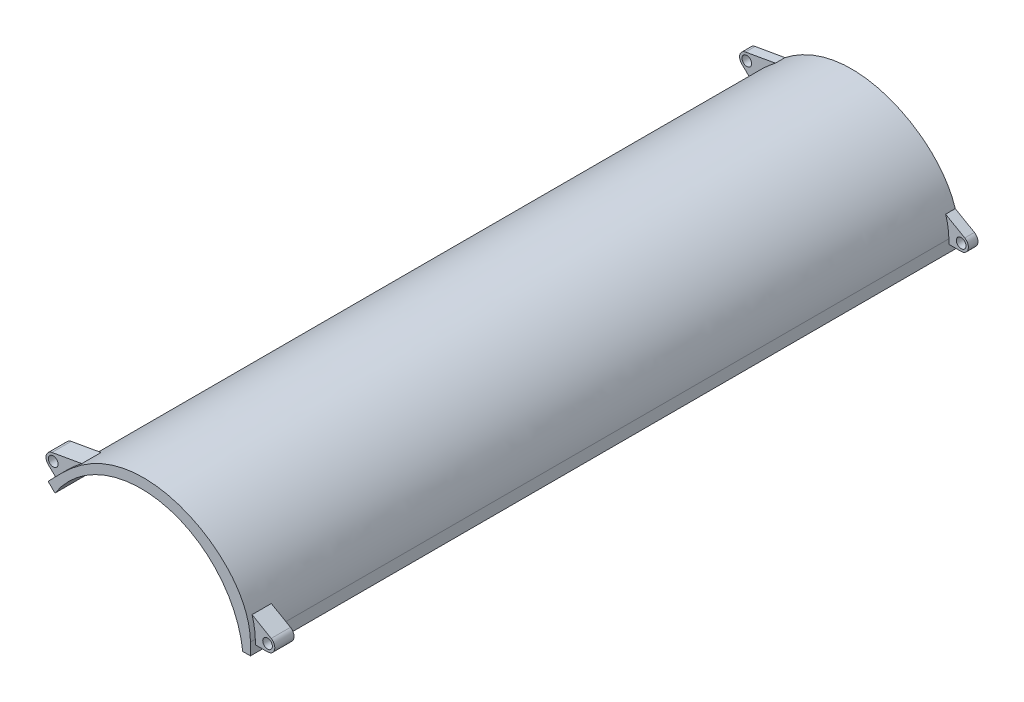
from build123d import *

# Parameters (mm, degrees)
BOSS_EXTRUDE1_DEPTH  = 735
BOSS_EXTRUDE13_START = -735
SKETCH3_R            = 10
BOSS_EXTRUDE13_DEPTH = 20
BOSS_EXTRUDE14_START = 685
SKETCH3_8_R          = 10
BOSS_EXTRUDE14_DEPTH = 40


with BuildPart() as part:
    # Sketch1 → Boss-Extrude1 (new, symmetric)
    with BuildSketch(Plane.XY):
        with BuildLine():
            Line((479.524287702, 25), (479.524287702, 50))
            add(Edge.make_bspline(
                [(69.720027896, 139.572690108), (108.18754722, 179.583185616), (152.416815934, 225.586540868), (219.133886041, 251.435560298), (287.408844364, 253.328836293), (359.356081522, 236.563554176), (477.15378099, 170.567422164), (479.524287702, 50)],
                knots=[0, 0, 0, 0, 0, 0, 0, 0, 1, 1, 1, 1, 1, 1, 1, 1], degree=7))
            Line((69.720027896, 139.572690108), (59.323974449, 128.759639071))
            Line((59.323974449, 128.759639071), (73.741375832, 114.898234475))
            ThreePointArc((73.741375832, 114.898234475), (300.256584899, 207.064141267), (463.524287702, 25))
            Line((463.524287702, 25), (479.524287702, 25))
        make_face()
    extrude(amount=BOSS_EXTRUDE1_DEPTH, both=True)

    # Sketch3 → Boss-Extrude13 (add)
    # profile 1 of 2: a face of its own
    with BuildSketch(Plane.XY.offset(BOSS_EXTRUDE13_START)):
        with BuildLine():
            Line((57.395277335, 174.772116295), (119.307330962, 185.688881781))
            add(Edge.make_bspline(
                [(69.720027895, 139.572690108), (76.074149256, 146.181682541), (82.585479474, 152.954189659), (89.329402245, 159.772367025), (96.35326765, 166.535005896), (103.683856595, 173.155904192), (111.333957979, 179.561593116), (119.307330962, 185.688881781)],
                knots=[0, 0, 0, 0, 0, 0, 0, 0, 0.165181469, 0.165181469, 0.165181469, 0.165181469, 0.165181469, 0.165181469, 0.165181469, 0.165181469], degree=7))
            Line((69.720027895, 139.572690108), (64.860756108, 134.518507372))
            Line((64.860756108, 134.518507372), (49.603946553, 149.186948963))
            ThreePointArc((49.603946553, 149.186948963), (45.650601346, 164.369754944), (57.395277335, 174.772116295))
        make_face()
        with Locations(Location((60, 160, 0), (0, 0, 180))):
            Circle(SKETCH3_R, mode=Mode.SUBTRACT)
    # profile 2 of 2: a face of its own
    with BuildSketch(Plane.XY.offset(BOSS_EXTRUDE13_START)):
        with BuildLine():
            Line((479.524287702, 50.000000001), (479.524287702, 40))
            Line((479.524287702, 40), (505, 40))
            ThreePointArc((505, 40), (519.488887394, 51.117714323), (512.5, 67.990381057))
            Line((512.5, 67.990381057), (472.826933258, 90.89563682))
            add(Edge.make_bspline(
                [(472.826933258, 90.89563682), (474.51705784, 85.487785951), (475.993797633, 79.937195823), (477.239796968, 74.242499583), (478.236465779, 68.402452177), (478.963896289, 62.415949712), (479.400774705, 56.282050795), (479.524287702, 50.000000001)],
                knots=[0.947895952, 0.947895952, 0.947895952, 0.947895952, 0.947895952, 0.947895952, 0.947895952, 0.947895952, 1, 1, 1, 1, 1, 1, 1, 1], degree=7))
        make_face()
        with Locations(Location((505, 55, 0), (0, 0, 180))):
            Circle(SKETCH3_R, mode=Mode.SUBTRACT)
    extrude(amount=BOSS_EXTRUDE13_DEPTH)

    # Sketch3_8 → Boss-Extrude14 (add)
    # profile 1 of 2: a face of its own
    with BuildSketch(Plane.XY.offset(BOSS_EXTRUDE14_START)):
        with BuildLine():
            Line((57.395277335, 174.772116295), (119.307330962, 185.688881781))
            add(Edge.make_bspline(
                [(69.720027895, 139.572690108), (76.074149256, 146.181682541), (82.585479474, 152.954189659), (89.329402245, 159.772367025), (96.35326765, 166.535005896), (103.683856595, 173.155904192), (111.333957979, 179.561593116), (119.307330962, 185.688881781)],
                knots=[0, 0, 0, 0, 0, 0, 0, 0, 0.165181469, 0.165181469, 0.165181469, 0.165181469, 0.165181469, 0.165181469, 0.165181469, 0.165181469], degree=7))
            Line((69.720027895, 139.572690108), (64.860756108, 134.518507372))
            Line((64.860756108, 134.518507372), (49.603946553, 149.186948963))
            ThreePointArc((49.603946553, 149.186948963), (45.650601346, 164.369754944), (57.395277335, 174.772116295))
        make_face()
        with Locations(Location((60, 160, 0), (0, 0, 180))):
            Circle(SKETCH3_8_R, mode=Mode.SUBTRACT)
    # profile 2 of 2: a face of its own
    with BuildSketch(Plane.XY.offset(BOSS_EXTRUDE14_START)):
        with BuildLine():
            Line((479.524287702, 50.000000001), (479.524287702, 40))
            Line((479.524287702, 40), (505, 40))
            ThreePointArc((505, 40), (519.488887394, 51.117714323), (512.5, 67.990381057))
            Line((512.5, 67.990381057), (472.826933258, 90.89563682))
            add(Edge.make_bspline(
                [(472.826933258, 90.89563682), (474.51705784, 85.487785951), (475.993797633, 79.937195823), (477.239796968, 74.242499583), (478.236465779, 68.402452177), (478.963896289, 62.415949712), (479.400774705, 56.282050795), (479.524287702, 50.000000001)],
                knots=[0.947895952, 0.947895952, 0.947895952, 0.947895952, 0.947895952, 0.947895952, 0.947895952, 0.947895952, 1, 1, 1, 1, 1, 1, 1, 1], degree=7))
        make_face()
        with Locations(Location((505, 55, 0), (0, 0, 180))):
            Circle(SKETCH3_8_R, mode=Mode.SUBTRACT)
    extrude(amount=BOSS_EXTRUDE14_DEPTH)


solid = part.part
